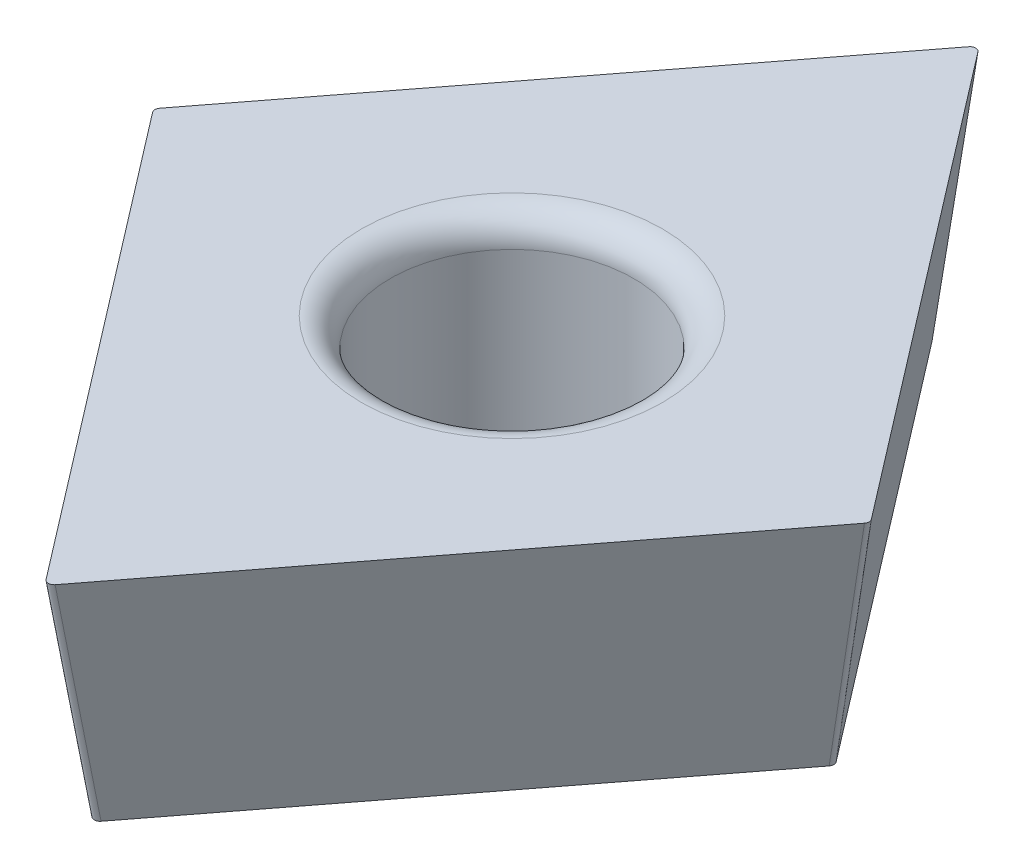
from build123d import *

# Parameters (mm, degrees)
BOSS_EXTRUDE1_DEPTH = 3.18
BOSS_EXTRUDE1_DRAFT = -7
FILLET1_R           = 0.08
CUT_EXTRUDE1_REACH  = 10.764
SKETCH5_R           = 1.7
FILLET2_R           = 0.4


with BuildPart() as part:
    # Sketch1 → Boss-Extrude1 (with draft: the straight prism first)
    with BuildSketch(Plane(origin=(0, 1.59, 0), x_dir=(1, 0, 0), z_dir=(0, 1, 0))):
        Polygon((5.004075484, 0), (0, 6.521438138), (-5.004075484, 0), (0, -6.521438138), align=None)
    extrude(amount=-BOSS_EXTRUDE1_DEPTH)
    # Boss-Extrude1: the draft: its side faces are tilted about the plane it starts from
    boss_extrude1_sides = [part.faces().sort_by_distance(p)[0] for p in [
        (2.502037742, 0, -3.260719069),
        (-2.502037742, 0, -3.260719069),
        (-2.502037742, 0, 3.260719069),
        (2.502037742, 0, 3.260719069),
    ]]
    draft(boss_extrude1_sides, Plane(origin=(0, 1.59, 0), x_dir=(1, 0, 0), z_dir=(0, 1, 0)), BOSS_EXTRUDE1_DRAFT)

    # Fillet1
    fillet1_edges = [part.edges().sort_by_distance(p)[0] for p in [
        (0, 0, 6.200741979),
        (-4.757996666, 0, 0),
        (0, 0, -6.200741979),
        (4.757996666, 0, 0),
    ]]
    fillet(fillet1_edges, radius=FILLET1_R)

    # Sketch5 → Cut-Extrude1 (cut, up to next)
    with BuildSketch(Plane(origin=(0, 1.59, 0), x_dir=(1, 0, 0), z_dir=(0, 1, 0)), mode=Mode.PRIVATE) as cut_extrude1_sk1:
        with Locations(Location((0, 0, 0), (0, 0, 270))):
            Circle(SKETCH5_R)
    cut_extrude1_tool1 = extrude(cut_extrude1_sk1.sketch, amount=-CUT_EXTRUDE1_REACH, mode=Mode.PRIVATE) & part.part
    add(cut_extrude1_tool1.solids().sort_by_distance((0, 1.59, 0))[0], mode=Mode.SUBTRACT)

    # Fillet2
    fillet2_edges = [part.edges().sort_by_distance(p)[0] for p in [
        (0, 1.59, -1.7),
    ]]
    fillet(fillet2_edges, radius=FILLET2_R)


solid = part.part
